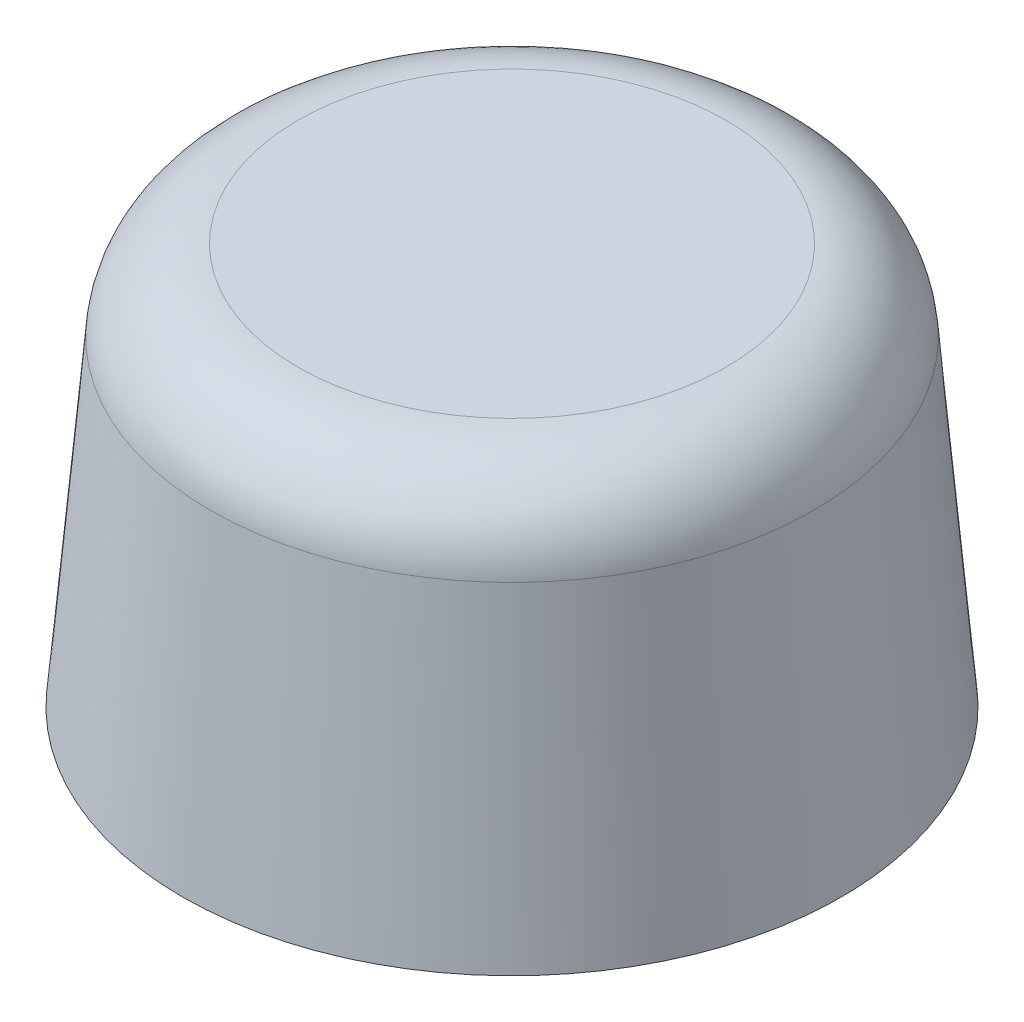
ISO-10303-21;
HEADER;
FILE_DESCRIPTION(('STEP AP214'),'2;1');
FILE_NAME('part.step','',(''),(''),'','','');
FILE_SCHEMA(('AUTOMOTIVE_DESIGN { 1 0 10303 214 1 1 1 1 }'));
ENDSEC;
DATA;
#1=APPLICATION_CONTEXT('core data for automotive mechanical design processes');
#2=APPLICATION_PROTOCOL_DEFINITION('international standard','automotive_design',2000,#1);
#3=PRODUCT_CONTEXT('',#1,'mechanical');
#4=PRODUCT('Part','Part','',(#3));
#5=PRODUCT_RELATED_PRODUCT_CATEGORY('part','',(#4));
#6=PRODUCT_DEFINITION_FORMATION('','',#4);
#7=PRODUCT_DEFINITION_CONTEXT('part definition',#1,'design');
#8=PRODUCT_DEFINITION('design','',#6,#7);
#9=PRODUCT_DEFINITION_SHAPE('','',#8);
#10=(LENGTH_UNIT() NAMED_UNIT(*) SI_UNIT(.MILLI.,.METRE.));
#11=(NAMED_UNIT(*) PLANE_ANGLE_UNIT() SI_UNIT($,.RADIAN.));
#12=(NAMED_UNIT(*) SI_UNIT($,.STERADIAN.) SOLID_ANGLE_UNIT());
#13=UNCERTAINTY_MEASURE_WITH_UNIT(LENGTH_MEASURE(1.E-05),#10,'distance_accuracy_value','');
#14=(GEOMETRIC_REPRESENTATION_CONTEXT(3) GLOBAL_UNCERTAINTY_ASSIGNED_CONTEXT((#13)) GLOBAL_UNIT_ASSIGNED_CONTEXT((#10,
#11,#12)) REPRESENTATION_CONTEXT('',''));
#15=CARTESIAN_POINT('',(0.,0.,0.));
#16=DIRECTION('',(0.,0.,1.));
#17=DIRECTION('',(1.,0.,0.));
#18=AXIS2_PLACEMENT_3D('',#15,#16,#17);
#19=CARTESIAN_POINT('',(0.,0.,0.));
#20=DIRECTION('',(0.,-1.,0.));
#21=DIRECTION('',(0.,0.,1.));
#22=AXIS2_PLACEMENT_3D('',#19,#20,#21);
#23=CONICAL_SURFACE('',#22,38.1,0.0872664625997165);
#24=CARTESIAN_POINT('',(0.,37.0805023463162,0.));
#25=DIRECTION('',(0.,-1.,0.));
#26=DIRECTION('',(0.,0.,-1.));
#27=AXIS2_PLACEMENT_3D('',#24,#25,#26);
#28=CIRCLE('',#27,34.8558764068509);
#29=CARTESIAN_POINT('',(0.,37.0805023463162,-34.8558764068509));
#30=VERTEX_POINT('',#29);
#31=EDGE_CURVE('E10',#30,#30,#28,.T.);
#32=ORIENTED_EDGE('',*,*,#31,.T.);
#33=EDGE_LOOP('',(#32));
#34=FACE_BOUND('',#33,.T.);
#35=CARTESIAN_POINT('',(0.,0.,0.));
#36=DIRECTION('',(0.,1.,0.));
#37=DIRECTION('',(0.,0.,1.));
#38=AXIS2_PLACEMENT_3D('',#35,#36,#37);
#39=CIRCLE('',#38,38.1);
#40=CARTESIAN_POINT('',(0.,0.,38.1));
#41=VERTEX_POINT('',#40);
#42=EDGE_CURVE('E41',#41,#41,#39,.T.);
#43=ORIENTED_EDGE('',*,*,#42,.T.);
#44=EDGE_LOOP('',(#43));
#45=FACE_BOUND('',#44,.T.);
#46=ADVANCED_FACE('F30',(#34,#45),#23,.T.);
#47=CARTESIAN_POINT('',(0.,46.355,0.));
#48=DIRECTION('',(0.,1.,0.));
#49=DIRECTION('',(0.,0.,1.));
#50=AXIS2_PLACEMENT_3D('',#47,#48,#49);
#51=PLANE('',#50);
#52=CARTESIAN_POINT('',(0.,46.355,0.));
#53=DIRECTION('',(0.,1.,0.));
#54=DIRECTION('',(0.,0.,1.));
#55=AXIS2_PLACEMENT_3D('',#52,#53,#54);
#56=CIRCLE('',#55,24.7345382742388);
#57=CARTESIAN_POINT('',(0.,46.355,24.7345382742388));
#58=VERTEX_POINT('',#57);
#59=EDGE_CURVE('E37',#58,#58,#56,.T.);
#60=ORIENTED_EDGE('',*,*,#59,.T.);
#61=EDGE_LOOP('',(#60));
#62=FACE_BOUND('',#61,.T.);
#63=ADVANCED_FACE('F51',(#62),#51,.T.);
#64=CARTESIAN_POINT('',(0.,0.,0.));
#65=DIRECTION('',(0.,1.,0.));
#66=DIRECTION('',(0.,0.,1.));
#67=AXIS2_PLACEMENT_3D('',#64,#65,#66);
#68=PLANE('',#67);
#69=ORIENTED_EDGE('',*,*,#42,.F.);
#70=EDGE_LOOP('',(#69));
#71=FACE_BOUND('',#70,.T.);
#72=ADVANCED_FACE('F49',(#71),#68,.F.);
#73=CARTESIAN_POINT('',(0.,36.195,0.));
#74=DIRECTION('',(0.,1.,0.));
#75=DIRECTION('',(0.,0.,1.));
#76=AXIS2_PLACEMENT_3D('',#73,#74,#75);
#77=TOROIDAL_SURFACE('',#76,24.7345382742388,10.16);
#78=ORIENTED_EDGE('',*,*,#31,.F.);
#79=EDGE_LOOP('',(#78));
#80=FACE_BOUND('',#79,.T.);
#81=ORIENTED_EDGE('',*,*,#59,.F.);
#82=EDGE_LOOP('',(#81));
#83=FACE_BOUND('',#82,.T.);
#84=ADVANCED_FACE('F32',(#80,#83),#77,.T.);
#85=CLOSED_SHELL('',(#46,#63,#72,#84));
#86=MANIFOLD_SOLID_BREP('B2',#85);
#87=ADVANCED_BREP_SHAPE_REPRESENTATION('',(#18,#86),#14);
#88=SHAPE_DEFINITION_REPRESENTATION(#9,#87);
ENDSEC;
END-ISO-10303-21;
